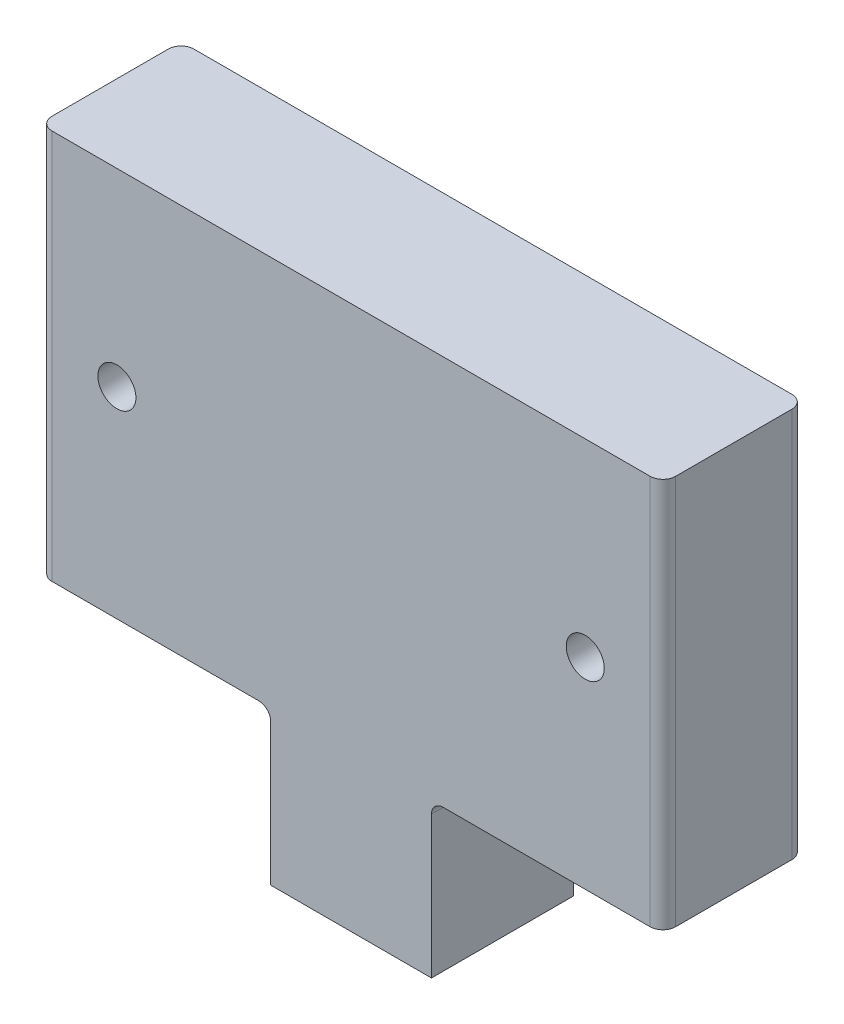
from build123d import *

# Parameters (mm, degrees)
SKETCH1_W               = 83.7438
SKETCH1_H               = 52.3875
BOSS_EXTRUDE1_DEPTH     = 9.525
F_1_4_20_TAPPED_HOLE1_D = 5.1054
SKETCH6_W               = 21.59
SKETCH6_H               = 20.6375
BOSS_EXTRUDE2_DEPTH     = 19.05
FILLET1_R               = 1.7145
FILLET2_R               = 1.5875


with BuildPart() as part:
    # Sketch1 → Boss-Extrude1 (new, symmetric)
    with BuildSketch(Plane.XY):
        Rectangle(SKETCH1_W, SKETCH1_H)
    extrude(amount=BOSS_EXTRUDE1_DEPTH, both=True)

    # 1_4-20 Tapped Hole1 (through all)
    with Locations(Plane.XY.offset(9.525)):
        with Locations((-31.4452, 0.79375), (31.4452, 0.79375)):
            Hole(F_1_4_20_TAPPED_HOLE1_D / 2)

    # Sketch6 → Boss-Extrude2 (add)
    with BuildSketch(Plane.XY.offset(9.525)):
        with Locations((0, -36.5125)):
            Rectangle(SKETCH6_W, SKETCH6_H)
    extrude(amount=-BOSS_EXTRUDE2_DEPTH)

    # Fillet1
    fillet1_edges = [part.edges().sort_by_distance(p)[0] for p in [
        (-41.8719, 0, 9.525),
        (41.8719, 0, 9.525),
        (-41.8719, 0, -9.525),
        (41.8719, 0, -9.525),
    ]]
    fillet(fillet1_edges, radius=FILLET1_R)

    # Fillet2
    fillet2_edges = [part.edges().sort_by_distance(p)[0] for p in [
        (-10.795, -26.19375, 0),
        (10.795, -26.19375, 0),
    ]]
    fillet(fillet2_edges, radius=FILLET2_R)


solid = part.part
